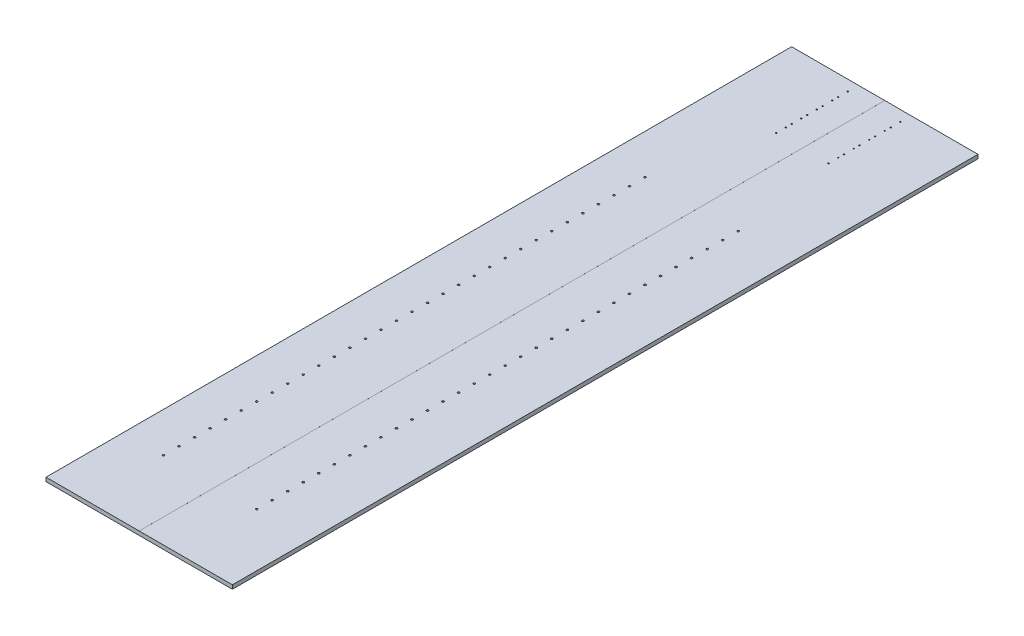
from build123d import *

# Parameters (mm, degrees)
SKETCH1_W                = 609.6
SKETCH1_H                = 2438.4
BOSS_EXTRUDE1_DEPTH      = 12.7
F_5_16_18_TAPPED_HOLE1_D = 6.5278
LPATTERN1_COUNT          = 2
LPATTERN1_PITCH          = 304.8
LPATTERN1_COUNT_DIR2     = 32
LPATTERN1_PITCH_DIR2     = 50.8
F_10_32_TAPPED_HOLE1_D   = 4.0386
CUT_EXTRUDE1_DEPTH       = 1219.2


with BuildPart() as part:
    # Sketch1 → Boss-Extrude1 (new body)
    with BuildSketch(Plane(origin=(0, 0, 0), x_dir=(1, 0, 0), z_dir=(0, 1, 0))):
        Rectangle(SKETCH1_W, SKETCH1_H)
    extrude(amount=BOSS_EXTRUDE1_DEPTH)

    # 5_16-18 Tapped Hole1 (through all)
    with Locations(Plane(origin=(0, 12.7, 0), x_dir=(1, 0, 0), z_dir=(0, 1, 0))):
        with Locations((-174.625, 609.6)):
            f_5_16_18_tapped_hole1 = Hole(F_5_16_18_TAPPED_HOLE1_D / 2)

    # LPattern1: 5_16-18 Tapped Hole1 2 × 32
    with Locations(*[(i * LPATTERN1_PITCH, 0, j * LPATTERN1_PITCH_DIR2) for i in range(LPATTERN1_COUNT) for j in range(LPATTERN1_COUNT_DIR2) if (i, j) != (0, 0)]):
        add(f_5_16_18_tapped_hole1, mode=Mode.SUBTRACT)

    # 10-32 Tapped Hole1 (through all)
    with Locations(Plane(origin=(0, 12.7, 0), x_dir=(1, 0, 0), z_dir=(0, 1, 0))):
        with Locations((-85.725, 1184.275), (-85.725, 1152.525), (-85.725, 1133.475), (-85.725, 1101.725), (-85.725, 1082.675), (-85.725, 1050.925), (-85.725, 1031.875), (-85.725, 1000.125), (-85.725, 981.075), (-85.725, 949.325), (85.725, 949.325), (85.725, 981.075), (85.725, 1000.125), (85.725, 1031.875), (85.725, 1050.925), (85.725, 1082.675), (85.725, 1101.725), (85.725, 1133.475), (85.725, 1152.525), (85.725, 1184.275)):
            Hole(F_10_32_TAPPED_HOLE1_D / 2)

    # Sketch6 → Cut-Extrude1 (cut, symmetric)
    with BuildSketch(Plane.XY):
        Polygon((-0.016719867, 12.7), (0, 12.573), (0.016719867, 12.7), align=None)
    extrude(amount=CUT_EXTRUDE1_DEPTH, both=True, mode=Mode.SUBTRACT)


solid = part.part
